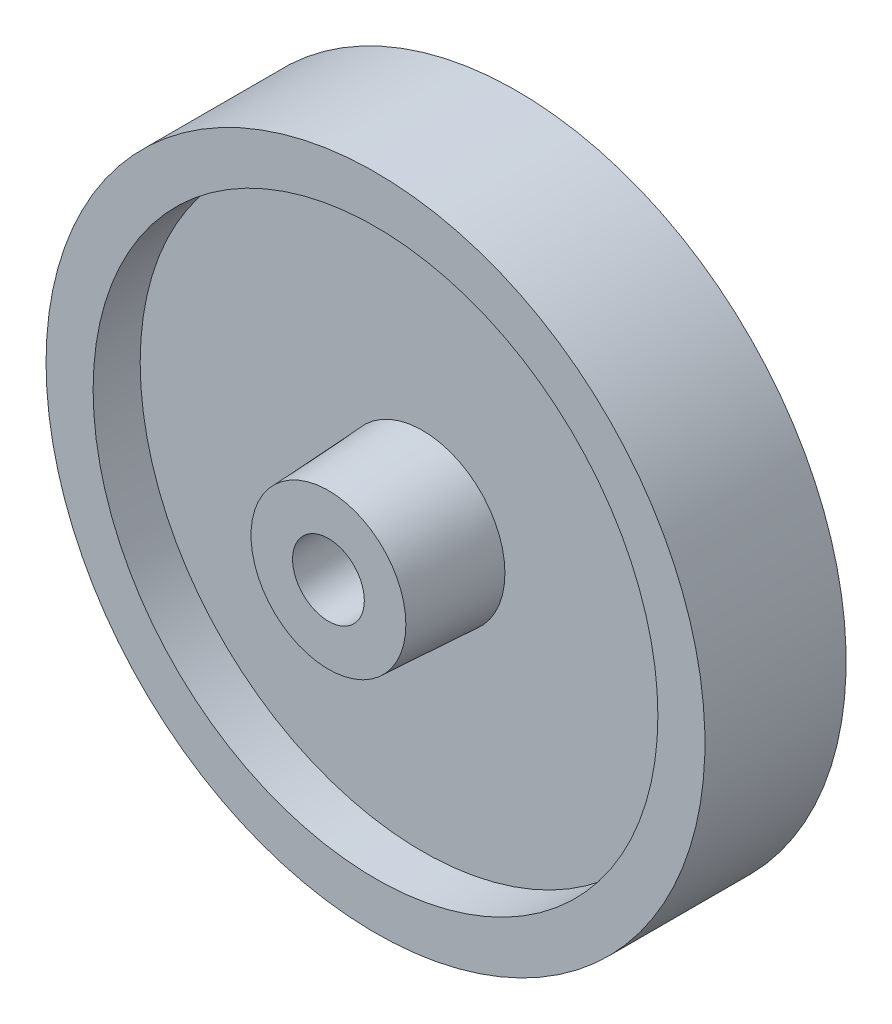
ISO-10303-21;
HEADER;
FILE_DESCRIPTION(('STEP AP214'),'2;1');
FILE_NAME('part.step','',(''),(''),'','','');
FILE_SCHEMA(('AUTOMOTIVE_DESIGN { 1 0 10303 214 1 1 1 1 }'));
ENDSEC;
DATA;
#1=APPLICATION_CONTEXT('core data for automotive mechanical design processes');
#2=APPLICATION_PROTOCOL_DEFINITION('international standard','automotive_design',2000,#1);
#3=PRODUCT_CONTEXT('',#1,'mechanical');
#4=PRODUCT('Part','Part','',(#3));
#5=PRODUCT_RELATED_PRODUCT_CATEGORY('part','',(#4));
#6=PRODUCT_DEFINITION_FORMATION('','',#4);
#7=PRODUCT_DEFINITION_CONTEXT('part definition',#1,'design');
#8=PRODUCT_DEFINITION('design','',#6,#7);
#9=PRODUCT_DEFINITION_SHAPE('','',#8);
#10=(LENGTH_UNIT() NAMED_UNIT(*) SI_UNIT(.MILLI.,.METRE.));
#11=(NAMED_UNIT(*) PLANE_ANGLE_UNIT() SI_UNIT($,.RADIAN.));
#12=(NAMED_UNIT(*) SI_UNIT($,.STERADIAN.) SOLID_ANGLE_UNIT());
#13=UNCERTAINTY_MEASURE_WITH_UNIT(LENGTH_MEASURE(1.E-05),#10,'distance_accuracy_value','');
#14=(GEOMETRIC_REPRESENTATION_CONTEXT(3) GLOBAL_UNCERTAINTY_ASSIGNED_CONTEXT((#13)) GLOBAL_UNIT_ASSIGNED_CONTEXT((#10,
#11,#12)) REPRESENTATION_CONTEXT('',''));
#15=CARTESIAN_POINT('',(0.,0.,0.));
#16=DIRECTION('',(0.,0.,1.));
#17=DIRECTION('',(1.,0.,0.));
#18=AXIS2_PLACEMENT_3D('',#15,#16,#17);
#19=CARTESIAN_POINT('',(0.,0.,0.));
#20=DIRECTION('',(0.,0.,1.));
#21=DIRECTION('',(1.,0.,0.));
#22=AXIS2_PLACEMENT_3D('',#19,#20,#21);
#23=PLANE('',#22);
#24=CARTESIAN_POINT('',(0.,0.,0.));
#25=DIRECTION('',(0.,0.,1.));
#26=DIRECTION('',(1.,0.,0.));
#27=AXIS2_PLACEMENT_3D('',#24,#25,#26);
#28=CIRCLE('',#27,12.);
#29=CARTESIAN_POINT('',(12.,0.,0.));
#30=VERTEX_POINT('',#29);
#31=EDGE_CURVE('E10',#30,#30,#28,.F.);
#32=ORIENTED_EDGE('',*,*,#31,.F.);
#33=EDGE_LOOP('',(#32));
#34=FACE_BOUND('',#33,.T.);
#35=CARTESIAN_POINT('',(0.,0.,0.));
#36=DIRECTION('',(0.,0.,1.));
#37=DIRECTION('',(1.,0.,0.));
#38=AXIS2_PLACEMENT_3D('',#35,#36,#37);
#39=CIRCLE('',#38,3.5);
#40=CARTESIAN_POINT('',(3.50000000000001,0.,0.));
#41=VERTEX_POINT('',#40);
#42=EDGE_CURVE('E35',#41,#41,#39,.T.);
#43=ORIENTED_EDGE('',*,*,#42,.F.);
#44=EDGE_LOOP('',(#43));
#45=FACE_BOUND('',#44,.T.);
#46=ADVANCED_FACE('F22',(#34,#45),#23,.T.);
#47=CARTESIAN_POINT('',(0.,0.,-2.));
#48=DIRECTION('',(0.,0.,1.));
#49=DIRECTION('',(1.,0.,0.));
#50=AXIS2_PLACEMENT_3D('',#47,#48,#49);
#51=PLANE('',#50);
#52=CARTESIAN_POINT('',(0.,0.,-2.));
#53=DIRECTION('',(0.,0.,1.));
#54=DIRECTION('',(1.,0.,0.));
#55=AXIS2_PLACEMENT_3D('',#52,#53,#54);
#56=CIRCLE('',#55,12.);
#57=CARTESIAN_POINT('',(12.,0.,-2.));
#58=VERTEX_POINT('',#57);
#59=EDGE_CURVE('E26',#58,#58,#56,.F.);
#60=ORIENTED_EDGE('',*,*,#59,.T.);
#61=EDGE_LOOP('',(#60));
#62=FACE_BOUND('',#61,.T.);
#63=CARTESIAN_POINT('',(0.,0.,-2.));
#64=DIRECTION('',(0.,0.,1.));
#65=DIRECTION('',(1.,0.,0.));
#66=AXIS2_PLACEMENT_3D('',#63,#64,#65);
#67=CIRCLE('',#66,1.525);
#68=CARTESIAN_POINT('',(1.525,0.,-2.));
#69=VERTEX_POINT('',#68);
#70=EDGE_CURVE('E43',#69,#69,#67,.T.);
#71=ORIENTED_EDGE('',*,*,#70,.T.);
#72=EDGE_LOOP('',(#71));
#73=FACE_BOUND('',#72,.T.);
#74=ADVANCED_FACE('F51',(#62,#73),#51,.F.);
#75=CARTESIAN_POINT('',(0.,0.,0.));
#76=DIRECTION('',(0.,0.,-1.));
#77=DIRECTION('',(1.,0.,0.));
#78=AXIS2_PLACEMENT_3D('',#75,#76,#77);
#79=CONICAL_SURFACE('',#78,3.5,0.05235987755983);
#80=CARTESIAN_POINT('',(0.,0.,4.));
#81=DIRECTION('',(0.,0.,1.));
#82=DIRECTION('',(1.,0.,0.));
#83=AXIS2_PLACEMENT_3D('',#80,#81,#82);
#84=CIRCLE('',#83,3.29036888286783);
#85=CARTESIAN_POINT('',(3.29036888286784,0.,4.));
#86=VERTEX_POINT('',#85);
#87=EDGE_CURVE('E30',#86,#86,#84,.T.);
#88=ORIENTED_EDGE('',*,*,#87,.F.);
#89=EDGE_LOOP('',(#88));
#90=FACE_BOUND('',#89,.T.);
#91=ORIENTED_EDGE('',*,*,#42,.T.);
#92=EDGE_LOOP('',(#91));
#93=FACE_BOUND('',#92,.T.);
#94=ADVANCED_FACE('F24',(#90,#93),#79,.T.);
#95=CARTESIAN_POINT('',(0.,0.,4.));
#96=DIRECTION('',(0.,0.,1.));
#97=DIRECTION('',(1.,0.,0.));
#98=AXIS2_PLACEMENT_3D('',#95,#96,#97);
#99=PLANE('',#98);
#100=CARTESIAN_POINT('',(0.,0.,4.));
#101=DIRECTION('',(0.,0.,1.));
#102=DIRECTION('',(1.,0.,0.));
#103=AXIS2_PLACEMENT_3D('',#100,#101,#102);
#104=CIRCLE('',#103,1.525);
#105=CARTESIAN_POINT('',(1.525,0.,4.));
#106=VERTEX_POINT('',#105);
#107=EDGE_CURVE('E40',#106,#106,#104,.T.);
#108=ORIENTED_EDGE('',*,*,#107,.F.);
#109=EDGE_LOOP('',(#108));
#110=FACE_BOUND('',#109,.T.);
#111=ORIENTED_EDGE('',*,*,#87,.T.);
#112=EDGE_LOOP('',(#111));
#113=FACE_BOUND('',#112,.T.);
#114=ADVANCED_FACE('F60',(#110,#113),#99,.T.);
#115=CARTESIAN_POINT('',(0.,0.,-2.));
#116=DIRECTION('',(0.,0.,1.));
#117=DIRECTION('',(1.,0.,0.));
#118=AXIS2_PLACEMENT_3D('',#115,#116,#117);
#119=CYLINDRICAL_SURFACE('',#118,1.525);
#120=ORIENTED_EDGE('',*,*,#70,.F.);
#121=EDGE_LOOP('',(#120));
#122=FACE_BOUND('',#121,.T.);
#123=ORIENTED_EDGE('',*,*,#107,.T.);
#124=EDGE_LOOP('',(#123));
#125=FACE_BOUND('',#124,.T.);
#126=ADVANCED_FACE('F97',(#122,#125),#119,.F.);
#127=CARTESIAN_POINT('',(0.,0.,-4.));
#128=DIRECTION('',(0.,0.,-1.));
#129=DIRECTION('',(-1.,0.,0.));
#130=AXIS2_PLACEMENT_3D('',#127,#128,#129);
#131=PLANE('',#130);
#132=CARTESIAN_POINT('',(0.,0.,-4.));
#133=DIRECTION('',(0.,0.,-1.));
#134=DIRECTION('',(-1.,0.,0.));
#135=AXIS2_PLACEMENT_3D('',#132,#133,#134);
#136=CIRCLE('',#135,14.);
#137=CARTESIAN_POINT('',(-14.,0.,-4.));
#138=VERTEX_POINT('',#137);
#139=EDGE_CURVE('E38',#138,#138,#136,.T.);
#140=ORIENTED_EDGE('',*,*,#139,.T.);
#141=EDGE_LOOP('',(#140));
#142=FACE_BOUND('',#141,.T.);
#143=CARTESIAN_POINT('',(0.,0.,-4.));
#144=DIRECTION('',(0.,0.,-1.));
#145=DIRECTION('',(-1.,0.,0.));
#146=AXIS2_PLACEMENT_3D('',#143,#144,#145);
#147=CIRCLE('',#146,12.);
#148=CARTESIAN_POINT('',(-12.,0.,-4.));
#149=VERTEX_POINT('',#148);
#150=EDGE_CURVE('E82',#149,#149,#147,.T.);
#151=ORIENTED_EDGE('',*,*,#150,.F.);
#152=EDGE_LOOP('',(#151));
#153=FACE_BOUND('',#152,.T.);
#154=ADVANCED_FACE('F73',(#142,#153),#131,.T.);
#155=CARTESIAN_POINT('',(0.,0.,-4.));
#156=DIRECTION('',(0.,0.,1.));
#157=DIRECTION('',(1.,0.,0.));
#158=AXIS2_PLACEMENT_3D('',#155,#156,#157);
#159=CYLINDRICAL_SURFACE('',#158,12.);
#160=ORIENTED_EDGE('',*,*,#150,.T.);
#161=EDGE_LOOP('',(#160));
#162=FACE_BOUND('',#161,.T.);
#163=ORIENTED_EDGE('',*,*,#59,.F.);
#164=EDGE_LOOP('',(#163));
#165=FACE_BOUND('',#164,.T.);
#166=ADVANCED_FACE('F65',(#162,#165),#159,.F.);
#167=CARTESIAN_POINT('',(0.,0.,-2.));
#168=DIRECTION('',(0.,0.,1.));
#169=DIRECTION('',(1.,0.,0.));
#170=AXIS2_PLACEMENT_3D('',#167,#168,#169);
#171=CYLINDRICAL_SURFACE('',#170,14.);
#172=ORIENTED_EDGE('',*,*,#139,.F.);
#173=EDGE_LOOP('',(#172));
#174=FACE_BOUND('',#173,.T.);
#175=CARTESIAN_POINT('',(0.,0.,2.));
#176=DIRECTION('',(0.,0.,-1.));
#177=DIRECTION('',(-1.,0.,0.));
#178=AXIS2_PLACEMENT_3D('',#175,#176,#177);
#179=CIRCLE('',#178,14.);
#180=CARTESIAN_POINT('',(-14.,0.,2.));
#181=VERTEX_POINT('',#180);
#182=EDGE_CURVE('E80',#181,#181,#179,.T.);
#183=ORIENTED_EDGE('',*,*,#182,.T.);
#184=EDGE_LOOP('',(#183));
#185=FACE_BOUND('',#184,.T.);
#186=ADVANCED_FACE('F62',(#174,#185),#171,.T.);
#187=ORIENTED_EDGE('',*,*,#31,.T.);
#188=EDGE_LOOP('',(#187));
#189=FACE_BOUND('',#188,.T.);
#190=CARTESIAN_POINT('',(0.,0.,2.));
#191=DIRECTION('',(0.,0.,-1.));
#192=DIRECTION('',(-1.,0.,0.));
#193=AXIS2_PLACEMENT_3D('',#190,#191,#192);
#194=CIRCLE('',#193,12.);
#195=CARTESIAN_POINT('',(-12.,0.,2.));
#196=VERTEX_POINT('',#195);
#197=EDGE_CURVE('E83',#196,#196,#194,.T.);
#198=ORIENTED_EDGE('',*,*,#197,.F.);
#199=EDGE_LOOP('',(#198));
#200=FACE_BOUND('',#199,.T.);
#201=ADVANCED_FACE('F64',(#189,#200),#159,.F.);
#202=CARTESIAN_POINT('',(0.,0.,2.));
#203=DIRECTION('',(0.,0.,-1.));
#204=DIRECTION('',(-1.,0.,0.));
#205=AXIS2_PLACEMENT_3D('',#202,#203,#204);
#206=PLANE('',#205);
#207=ORIENTED_EDGE('',*,*,#197,.T.);
#208=EDGE_LOOP('',(#207));
#209=FACE_BOUND('',#208,.T.);
#210=ORIENTED_EDGE('',*,*,#182,.F.);
#211=EDGE_LOOP('',(#210));
#212=FACE_BOUND('',#211,.T.);
#213=ADVANCED_FACE('F71',(#209,#212),#206,.F.);
#214=CLOSED_SHELL('',(#46,#74,#94,#114,#126,#154,#166,#186,#201,#213));
#215=MANIFOLD_SOLID_BREP('B2',#214);
#216=ADVANCED_BREP_SHAPE_REPRESENTATION('',(#18,#215),#14);
#217=SHAPE_DEFINITION_REPRESENTATION(#9,#216);
ENDSEC;
END-ISO-10303-21;
